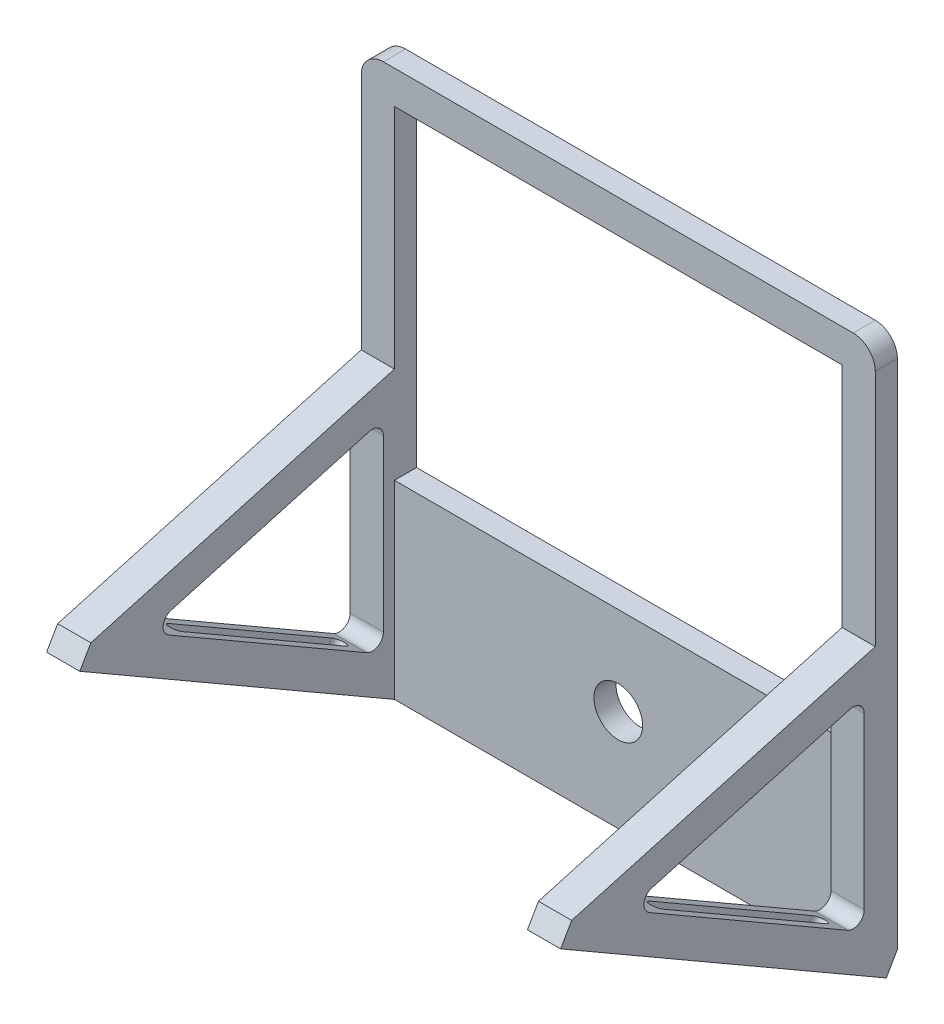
from build123d import *

# Parameters (mm, degrees)
SKIZZE1_W                       = 232.332085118
SKIZZE1_H                       = 241.332085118
SKIZZE1_W_2                     = 202.332085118
SKIZZE1_H_2                     = 146.332085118
AUFSATZ_LINEAR_AUSTRAGEN1_DEPTH = 10
AUFSATZ_LINEAR_AUSTRAGEN2_DEPTH = 232.332085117
AUFSATZ_LINEAR_START            = -232.332085
AUFSATZ_LINEAR_AUSTRAGEN3_DEPTH = 232.332085
SKIZZE4_W                       = 202.332085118
SKIZZE4_H                       = 181.826641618
SCHNITT_LINEAR_AUSTRAGEN1_DEPTH = 315.90151201
VERRUNDUNG1_R                   = 10
SCHNITT_LINEAR_AUSTRAGEN2_REACH = 252.708
SKIZZE5_R                       = 11
SCHNITT_LINEAR_AUSTRAGEN3_REACH = 256.67


with BuildPart() as part:
    # Skizze1 → Aufsatz-Linear austragen1 (new body)
    with BuildSketch(Plane.XY):
        with Locations((0, -32.5)):
            Rectangle(SKIZZE1_W, SKIZZE1_H)
        Rectangle(SKIZZE1_W_2, SKIZZE1_H_2, mode=Mode.SUBTRACT)
    extrude(amount=AUFSATZ_LINEAR_AUSTRAGEN1_DEPTH)

    # Skizze2 → Aufsatz-Linear austragen2 (add)
    with BuildSketch(Plane(origin=(116.166042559, 0, 0), x_dir=(0, 0, -1), z_dir=(1, 0, 0))):
        Polygon((0, -153.166042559), (-147.224318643, -68.166042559), (-152.224318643, -76.826296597), (-5, -161.826296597), align=None)
    extrude(amount=-AUFSATZ_LINEAR_AUSTRAGEN2_DEPTH)

    # Skizze3 → Aufsatz-Linear austragen3 (add)
    with BuildSketch(Plane(origin=(116.166042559, 0, 0), x_dir=(0, 0, -1), z_dir=(1, 0, 0)).offset(AUFSATZ_LINEAR_START)):
        Polygon((-147.224318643, -68.166042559), (-10, -147.392539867), (-10, -29.613248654), align=None)
        with BuildLine():
            Line((-112.066829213, -82.690725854), (-22.5, -134.40215881))
            ThreePointArc((-22.5, -134.40215881), (-17.5, -134.40215881), (-15, -130.072031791))
            Line((-15, -130.072031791), (-15, -53.197045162))
            ThreePointArc((-15, -53.197045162), (-16.980222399, -49.211955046), (-21.352377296, -48.383410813))
            Line((-21.352377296, -48.383410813), (-110.919206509, -73.546964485))
            ThreePointArc((-110.919206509, -73.546964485), (-114.527907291, -77.737939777), (-112.066829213, -82.690725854))
        make_face(mode=Mode.SUBTRACT)
    extrude(amount=AUFSATZ_LINEAR_AUSTRAGEN3_DEPTH)

    # Skizze4 → Schnitt-Linear austragen1 (cut, through all)
    with BuildSketch(Plane(origin=(0, 88.166042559, 0), x_dir=(1, 0, 0), z_dir=(0, 1, 0))):
        with Locations((0, -100.913320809)):
            Rectangle(SKIZZE4_W, SKIZZE4_H)
    extrude(amount=-SCHNITT_LINEAR_AUSTRAGEN1_DEPTH, mode=Mode.SUBTRACT)

    # Verrundung1
    verrundung1_edges = [part.edges().sort_by_distance(p)[0] for p in [
        (-116.166042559, 88.166042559, 5),
        (116.166042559, 88.166042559, 5),
    ]]
    fillet(verrundung1_edges, radius=VERRUNDUNG1_R)

    # Skizze5 → Schnitt-Linear austragen2 (cut, up to next)
    with BuildSketch(Plane(origin=(0, 0, 0), x_dir=(-1, 0, 0), z_dir=(0, 0, -1)), mode=Mode.PRIVATE) as schnitt_linear_austragen2_sk1:
        with Locations((0, -113.166042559)):
            Circle(SKIZZE5_R)
    schnitt_linear_austragen2_tool1 = extrude(schnitt_linear_austragen2_sk1.sketch, amount=-SCHNITT_LINEAR_AUSTRAGEN2_REACH, mode=Mode.PRIVATE) & part.part
    add(schnitt_linear_austragen2_tool1.solids().sort_by_distance((0, -113.166043, 0))[0], mode=Mode.SUBTRACT)

    # Skizze8 → Schnitt-Linear austragen3 (cut, up to next)
    with BuildSketch(Plane(origin=(0, -123.534785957, 71.322841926), x_dir=(1, 0, 0), z_dir=(0, -0.8660254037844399, 0.499999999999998)), mode=Mode.PRIVATE) as schnitt_linear_austragen3_sk1:
        with BuildLine():
            Line((-105.466042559, 43.416978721), (-105.466042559, -41.583021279))
            ThreePointArc((-105.466042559, -41.583021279), (-108.666042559, -44.783021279), (-111.866042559, -41.583021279))
            Line((-111.866042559, -41.583021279), (-111.866042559, 43.416978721))
            ThreePointArc((-111.866042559, 43.416978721), (-108.666042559, 46.616978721), (-105.466042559, 43.416978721))
        make_face()
    schnitt_linear_austragen3_tool1 = extrude(schnitt_linear_austragen3_sk1.sketch, amount=-SCHNITT_LINEAR_AUSTRAGEN3_REACH, mode=Mode.PRIVATE) & part.part
    # Skizze8 → Schnitt-Linear austragen3 (cut, up to next)
    with BuildSketch(Plane(origin=(0, -123.534785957, 71.322841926), x_dir=(1, 0, 0), z_dir=(0, -0.8660254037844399, 0.499999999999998)), mode=Mode.PRIVATE) as schnitt_linear_austragen3_sk2:
        with BuildLine():
            Line((105.466042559, 43.416978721), (105.466042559, -41.583021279))
            ThreePointArc((105.466042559, -41.583021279), (108.666042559, -44.783021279), (111.866042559, -41.583021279))
            Line((111.866042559, -41.583021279), (111.866042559, 43.416978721))
            ThreePointArc((111.866042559, 43.416978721), (108.666042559, 46.616978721), (105.466042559, 43.416978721))
        make_face()
    schnitt_linear_austragen3_tool2 = extrude(schnitt_linear_austragen3_sk2.sketch, amount=-SCHNITT_LINEAR_AUSTRAGEN3_REACH, mode=Mode.PRIVATE) & part.part
    add(schnitt_linear_austragen3_tool1.solids().sort_by_distance((-108.666043, -123.076297, 72.116969))[0], mode=Mode.SUBTRACT)
    add(schnitt_linear_austragen3_tool2.solids().sort_by_distance((108.666043, -123.076297, 72.116969))[0], mode=Mode.SUBTRACT)


solid = part.part
